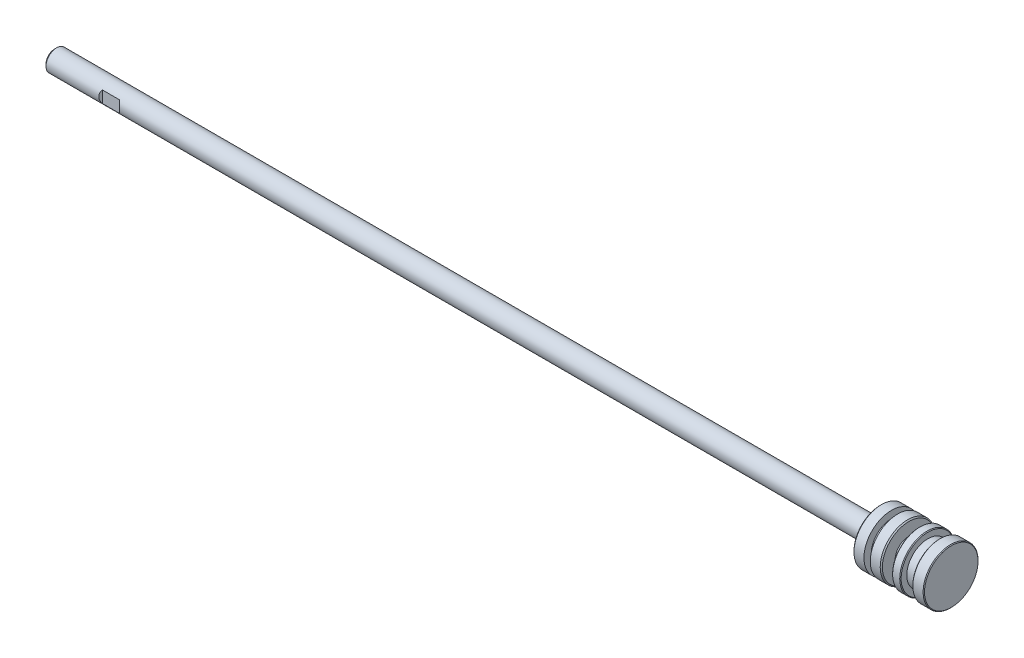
ISO-10303-21;
HEADER;
FILE_DESCRIPTION(('STEP AP214'),'2;1');
FILE_NAME('part.step','',(''),(''),'','','');
FILE_SCHEMA(('AUTOMOTIVE_DESIGN { 1 0 10303 214 1 1 1 1 }'));
ENDSEC;
DATA;
#1=APPLICATION_CONTEXT('core data for automotive mechanical design processes');
#2=APPLICATION_PROTOCOL_DEFINITION('international standard','automotive_design',2000,#1);
#3=PRODUCT_CONTEXT('',#1,'mechanical');
#4=PRODUCT('Part','Part','',(#3));
#5=PRODUCT_RELATED_PRODUCT_CATEGORY('part','',(#4));
#6=PRODUCT_DEFINITION_FORMATION('','',#4);
#7=PRODUCT_DEFINITION_CONTEXT('part definition',#1,'design');
#8=PRODUCT_DEFINITION('design','',#6,#7);
#9=PRODUCT_DEFINITION_SHAPE('','',#8);
#10=(LENGTH_UNIT() NAMED_UNIT(*) SI_UNIT(.MILLI.,.METRE.));
#11=(NAMED_UNIT(*) PLANE_ANGLE_UNIT() SI_UNIT($,.RADIAN.));
#12=(NAMED_UNIT(*) SI_UNIT($,.STERADIAN.) SOLID_ANGLE_UNIT());
#13=UNCERTAINTY_MEASURE_WITH_UNIT(LENGTH_MEASURE(1.E-05),#10,'distance_accuracy_value','');
#14=(GEOMETRIC_REPRESENTATION_CONTEXT(3) GLOBAL_UNCERTAINTY_ASSIGNED_CONTEXT((#13)) GLOBAL_UNIT_ASSIGNED_CONTEXT((#10,
#11,#12)) REPRESENTATION_CONTEXT('',''));
#15=CARTESIAN_POINT('',(0.,0.,0.));
#16=DIRECTION('',(0.,0.,1.));
#17=DIRECTION('',(1.,0.,0.));
#18=AXIS2_PLACEMENT_3D('',#15,#16,#17);
#19=CARTESIAN_POINT('',(253.,7.55,0.));
#20=DIRECTION('',(-1.,0.,0.));
#21=DIRECTION('',(0.,0.,1.));
#22=AXIS2_PLACEMENT_3D('',#19,#20,#21);
#23=PLANE('',#22);
#24=CARTESIAN_POINT('',(253.,0.,0.));
#25=DIRECTION('',(-1.,0.,0.));
#26=DIRECTION('',(0.,0.,1.));
#27=AXIS2_PLACEMENT_3D('',#24,#25,#26);
#28=CIRCLE('',#27,7.55);
#29=CARTESIAN_POINT('',(253.,0.,7.55));
#30=VERTEX_POINT('',#29);
#31=EDGE_CURVE('E20',#30,#30,#28,.T.);
#32=ORIENTED_EDGE('',*,*,#31,.F.);
#33=EDGE_LOOP('',(#32));
#34=FACE_BOUND('',#33,.T.);
#35=ADVANCED_FACE('F17',(#34),#23,.F.);
#36=CARTESIAN_POINT('',(252.8,0.,0.));
#37=DIRECTION('',(-1.,0.,0.));
#38=DIRECTION('',(0.,0.,1.));
#39=AXIS2_PLACEMENT_3D('',#36,#37,#38);
#40=CONICAL_SURFACE('',#39,7.75,0.785398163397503);
#41=ORIENTED_EDGE('',*,*,#31,.T.);
#42=EDGE_LOOP('',(#41));
#43=FACE_BOUND('',#42,.T.);
#44=CARTESIAN_POINT('',(252.8,0.,0.));
#45=DIRECTION('',(-1.,0.,0.));
#46=DIRECTION('',(0.,0.,1.));
#47=AXIS2_PLACEMENT_3D('',#44,#45,#46);
#48=CIRCLE('',#47,7.75);
#49=CARTESIAN_POINT('',(252.8,0.,7.75));
#50=VERTEX_POINT('',#49);
#51=EDGE_CURVE('E115',#50,#50,#48,.T.);
#52=ORIENTED_EDGE('',*,*,#51,.F.);
#53=EDGE_LOOP('',(#52));
#54=FACE_BOUND('',#53,.T.);
#55=ADVANCED_FACE('F471',(#43,#54),#40,.T.);
#56=CARTESIAN_POINT('',(253.,0.,0.));
#57=DIRECTION('',(-1.,0.,0.));
#58=DIRECTION('',(0.,0.,1.));
#59=AXIS2_PLACEMENT_3D('',#56,#57,#58);
#60=CYLINDRICAL_SURFACE('',#59,7.75);
#61=ORIENTED_EDGE('',*,*,#51,.T.);
#62=EDGE_LOOP('',(#61));
#63=FACE_BOUND('',#62,.T.);
#64=CARTESIAN_POINT('',(249.9,0.,0.));
#65=DIRECTION('',(1.,0.,0.));
#66=DIRECTION('',(0.,0.,-1.));
#67=AXIS2_PLACEMENT_3D('',#64,#65,#66);
#68=CIRCLE('',#67,7.75);
#69=CARTESIAN_POINT('',(249.9,0.,-7.75));
#70=VERTEX_POINT('',#69);
#71=EDGE_CURVE('E111',#70,#70,#68,.F.);
#72=ORIENTED_EDGE('',*,*,#71,.F.);
#73=EDGE_LOOP('',(#72));
#74=FACE_BOUND('',#73,.T.);
#75=ADVANCED_FACE('F463',(#63,#74),#60,.T.);
#76=CARTESIAN_POINT('',(249.9,0.,0.));
#77=DIRECTION('',(1.,0.,0.));
#78=DIRECTION('',(0.,1.,0.));
#79=AXIS2_PLACEMENT_3D('',#76,#77,#78);
#80=CONICAL_SURFACE('',#79,7.75,0.785398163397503);
#81=CARTESIAN_POINT('',(249.7,0.,0.));
#82=DIRECTION('',(1.,0.,0.));
#83=DIRECTION('',(0.,1.,0.));
#84=AXIS2_PLACEMENT_3D('',#81,#82,#83);
#85=CIRCLE('',#84,7.55);
#86=CARTESIAN_POINT('',(249.7,7.55,0.));
#87=VERTEX_POINT('',#86);
#88=EDGE_CURVE('E114',#87,#87,#85,.T.);
#89=ORIENTED_EDGE('',*,*,#88,.T.);
#90=EDGE_LOOP('',(#89));
#91=FACE_BOUND('',#90,.T.);
#92=ORIENTED_EDGE('',*,*,#71,.T.);
#93=EDGE_LOOP('',(#92));
#94=FACE_BOUND('',#93,.T.);
#95=ADVANCED_FACE('F156',(#91,#94),#80,.T.);
#96=CARTESIAN_POINT('',(249.7,5.95,0.));
#97=DIRECTION('',(1.,0.,0.));
#98=DIRECTION('',(0.,0.,-1.));
#99=AXIS2_PLACEMENT_3D('',#96,#97,#98);
#100=PLANE('',#99);
#101=ORIENTED_EDGE('',*,*,#88,.F.);
#102=EDGE_LOOP('',(#101));
#103=FACE_BOUND('',#102,.T.);
#104=CARTESIAN_POINT('',(249.7,0.,0.));
#105=DIRECTION('',(-1.,0.,0.));
#106=DIRECTION('',(0.,0.,1.));
#107=AXIS2_PLACEMENT_3D('',#104,#105,#106);
#108=CIRCLE('',#107,5.95);
#109=CARTESIAN_POINT('',(249.7,0.,5.95));
#110=VERTEX_POINT('',#109);
#111=EDGE_CURVE('E151',#110,#110,#108,.T.);
#112=ORIENTED_EDGE('',*,*,#111,.F.);
#113=EDGE_LOOP('',(#112));
#114=FACE_BOUND('',#113,.T.);
#115=ADVANCED_FACE('F159',(#103,#114),#100,.F.);
#116=CARTESIAN_POINT('',(253.,0.,0.));
#117=DIRECTION('',(-1.,0.,0.));
#118=DIRECTION('',(0.,0.,1.));
#119=AXIS2_PLACEMENT_3D('',#116,#117,#118);
#120=CYLINDRICAL_SURFACE('',#119,5.95);
#121=CARTESIAN_POINT('',(246.4,0.,0.));
#122=DIRECTION('',(-1.,0.,0.));
#123=DIRECTION('',(0.,0.,1.));
#124=AXIS2_PLACEMENT_3D('',#121,#122,#123);
#125=CIRCLE('',#124,5.95);
#126=CARTESIAN_POINT('',(246.4,0.,5.95));
#127=VERTEX_POINT('',#126);
#128=EDGE_CURVE('E148',#127,#127,#125,.F.);
#129=ORIENTED_EDGE('',*,*,#128,.T.);
#130=EDGE_LOOP('',(#129));
#131=FACE_BOUND('',#130,.T.);
#132=ORIENTED_EDGE('',*,*,#111,.T.);
#133=EDGE_LOOP('',(#132));
#134=FACE_BOUND('',#133,.T.);
#135=ADVANCED_FACE('F162',(#131,#134),#120,.T.);
#136=CARTESIAN_POINT('',(246.4,7.55,0.));
#137=DIRECTION('',(-1.,0.,0.));
#138=DIRECTION('',(0.,0.,1.));
#139=AXIS2_PLACEMENT_3D('',#136,#137,#138);
#140=PLANE('',#139);
#141=ORIENTED_EDGE('',*,*,#128,.F.);
#142=EDGE_LOOP('',(#141));
#143=FACE_BOUND('',#142,.T.);
#144=CARTESIAN_POINT('',(246.4,0.,0.));
#145=DIRECTION('',(-1.,0.,0.));
#146=DIRECTION('',(0.,-1.,0.));
#147=AXIS2_PLACEMENT_3D('',#144,#145,#146);
#148=CIRCLE('',#147,7.55);
#149=CARTESIAN_POINT('',(246.4,-7.55,0.));
#150=VERTEX_POINT('',#149);
#151=EDGE_CURVE('E110',#150,#150,#148,.T.);
#152=ORIENTED_EDGE('',*,*,#151,.F.);
#153=EDGE_LOOP('',(#152));
#154=FACE_BOUND('',#153,.T.);
#155=ADVANCED_FACE('F167',(#143,#154),#140,.F.);
#156=CARTESIAN_POINT('',(246.2,0.,0.));
#157=DIRECTION('',(-1.,0.,0.));
#158=DIRECTION('',(0.,-1.,0.));
#159=AXIS2_PLACEMENT_3D('',#156,#157,#158);
#160=CONICAL_SURFACE('',#159,7.75,0.785398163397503);
#161=ORIENTED_EDGE('',*,*,#151,.T.);
#162=EDGE_LOOP('',(#161));
#163=FACE_BOUND('',#162,.T.);
#164=CARTESIAN_POINT('',(246.2,0.,0.));
#165=DIRECTION('',(-1.,0.,0.));
#166=DIRECTION('',(0.,0.,1.));
#167=AXIS2_PLACEMENT_3D('',#164,#165,#166);
#168=CIRCLE('',#167,7.75);
#169=CARTESIAN_POINT('',(246.2,0.,7.75));
#170=VERTEX_POINT('',#169);
#171=EDGE_CURVE('E107',#170,#170,#168,.T.);
#172=ORIENTED_EDGE('',*,*,#171,.F.);
#173=EDGE_LOOP('',(#172));
#174=FACE_BOUND('',#173,.T.);
#175=ADVANCED_FACE('F174',(#163,#174),#160,.T.);
#176=CARTESIAN_POINT('',(253.,0.,0.));
#177=DIRECTION('',(-1.,0.,0.));
#178=DIRECTION('',(0.,0.,1.));
#179=AXIS2_PLACEMENT_3D('',#176,#177,#178);
#180=CYLINDRICAL_SURFACE('',#179,7.75);
#181=ORIENTED_EDGE('',*,*,#171,.T.);
#182=EDGE_LOOP('',(#181));
#183=FACE_BOUND('',#182,.T.);
#184=CARTESIAN_POINT('',(244.2,0.,0.));
#185=DIRECTION('',(1.,0.,0.));
#186=DIRECTION('',(0.,0.,-1.));
#187=AXIS2_PLACEMENT_3D('',#184,#185,#186);
#188=CIRCLE('',#187,7.75);
#189=CARTESIAN_POINT('',(244.2,0.,-7.75));
#190=VERTEX_POINT('',#189);
#191=EDGE_CURVE('E103',#190,#190,#188,.F.);
#192=ORIENTED_EDGE('',*,*,#191,.F.);
#193=EDGE_LOOP('',(#192));
#194=FACE_BOUND('',#193,.T.);
#195=ADVANCED_FACE('F256',(#183,#194),#180,.T.);
#196=CARTESIAN_POINT('',(244.2,0.,0.));
#197=DIRECTION('',(1.,0.,0.));
#198=DIRECTION('',(0.,0.,-1.));
#199=AXIS2_PLACEMENT_3D('',#196,#197,#198);
#200=CONICAL_SURFACE('',#199,7.75,0.785398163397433);
#201=CARTESIAN_POINT('',(244.,0.,0.));
#202=DIRECTION('',(1.,0.,0.));
#203=DIRECTION('',(0.,0.,-1.));
#204=AXIS2_PLACEMENT_3D('',#201,#202,#203);
#205=CIRCLE('',#204,7.55);
#206=CARTESIAN_POINT('',(244.,0.,-7.55));
#207=VERTEX_POINT('',#206);
#208=EDGE_CURVE('E106',#207,#207,#205,.T.);
#209=ORIENTED_EDGE('',*,*,#208,.T.);
#210=EDGE_LOOP('',(#209));
#211=FACE_BOUND('',#210,.T.);
#212=ORIENTED_EDGE('',*,*,#191,.T.);
#213=EDGE_LOOP('',(#212));
#214=FACE_BOUND('',#213,.T.);
#215=ADVANCED_FACE('F252',(#211,#214),#200,.T.);
#216=CARTESIAN_POINT('',(244.,3.85,0.));
#217=DIRECTION('',(1.,0.,0.));
#218=DIRECTION('',(0.,0.,-1.));
#219=AXIS2_PLACEMENT_3D('',#216,#217,#218);
#220=PLANE('',#219);
#221=ORIENTED_EDGE('',*,*,#208,.F.);
#222=EDGE_LOOP('',(#221));
#223=FACE_BOUND('',#222,.T.);
#224=CARTESIAN_POINT('',(244.,0.,0.));
#225=DIRECTION('',(-1.,0.,0.));
#226=DIRECTION('',(0.,0.,1.));
#227=AXIS2_PLACEMENT_3D('',#224,#225,#226);
#228=CIRCLE('',#227,3.85);
#229=CARTESIAN_POINT('',(244.,0.,3.85));
#230=VERTEX_POINT('',#229);
#231=EDGE_CURVE('E141',#230,#230,#228,.T.);
#232=ORIENTED_EDGE('',*,*,#231,.F.);
#233=EDGE_LOOP('',(#232));
#234=FACE_BOUND('',#233,.T.);
#235=ADVANCED_FACE('F248',(#223,#234),#220,.F.);
#236=CARTESIAN_POINT('',(253.,0.,0.));
#237=DIRECTION('',(-1.,0.,0.));
#238=DIRECTION('',(0.,0.,1.));
#239=AXIS2_PLACEMENT_3D('',#236,#237,#238);
#240=CYLINDRICAL_SURFACE('',#239,3.85);
#241=CARTESIAN_POINT('',(241.,0.,0.));
#242=DIRECTION('',(-1.,0.,0.));
#243=DIRECTION('',(0.,0.,1.));
#244=AXIS2_PLACEMENT_3D('',#241,#242,#243);
#245=CIRCLE('',#244,3.85);
#246=CARTESIAN_POINT('',(241.,0.,3.85));
#247=VERTEX_POINT('',#246);
#248=EDGE_CURVE('E138',#247,#247,#245,.F.);
#249=ORIENTED_EDGE('',*,*,#248,.T.);
#250=EDGE_LOOP('',(#249));
#251=FACE_BOUND('',#250,.T.);
#252=ORIENTED_EDGE('',*,*,#231,.T.);
#253=EDGE_LOOP('',(#252));
#254=FACE_BOUND('',#253,.T.);
#255=ADVANCED_FACE('F244',(#251,#254),#240,.T.);
#256=CARTESIAN_POINT('',(241.,7.45,0.));
#257=DIRECTION('',(-1.,0.,0.));
#258=DIRECTION('',(0.,0.,1.));
#259=AXIS2_PLACEMENT_3D('',#256,#257,#258);
#260=PLANE('',#259);
#261=ORIENTED_EDGE('',*,*,#248,.F.);
#262=EDGE_LOOP('',(#261));
#263=FACE_BOUND('',#262,.T.);
#264=CARTESIAN_POINT('',(241.,0.,0.));
#265=DIRECTION('',(-1.,0.,0.));
#266=DIRECTION('',(0.,-1.,0.));
#267=AXIS2_PLACEMENT_3D('',#264,#265,#266);
#268=CIRCLE('',#267,7.45);
#269=CARTESIAN_POINT('',(241.,-7.45,0.));
#270=VERTEX_POINT('',#269);
#271=EDGE_CURVE('E102',#270,#270,#268,.T.);
#272=ORIENTED_EDGE('',*,*,#271,.F.);
#273=EDGE_LOOP('',(#272));
#274=FACE_BOUND('',#273,.T.);
#275=ADVANCED_FACE('F240',(#263,#274),#260,.F.);
#276=CARTESIAN_POINT('',(240.7,0.,0.));
#277=DIRECTION('',(-1.,0.,0.));
#278=DIRECTION('',(0.,-1.,0.));
#279=AXIS2_PLACEMENT_3D('',#276,#277,#278);
#280=CONICAL_SURFACE('',#279,7.75,0.785398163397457);
#281=CARTESIAN_POINT('',(240.7,0.,0.));
#282=DIRECTION('',(-1.,0.,0.));
#283=DIRECTION('',(0.,0.,1.));
#284=AXIS2_PLACEMENT_3D('',#281,#282,#283);
#285=CIRCLE('',#284,7.75);
#286=CARTESIAN_POINT('',(240.7,0.,7.75));
#287=VERTEX_POINT('',#286);
#288=EDGE_CURVE('E98',#287,#287,#285,.T.);
#289=ORIENTED_EDGE('',*,*,#288,.F.);
#290=EDGE_LOOP('',(#289));
#291=FACE_BOUND('',#290,.T.);
#292=ORIENTED_EDGE('',*,*,#271,.T.);
#293=EDGE_LOOP('',(#292));
#294=FACE_BOUND('',#293,.T.);
#295=ADVANCED_FACE('F236',(#291,#294),#280,.T.);
#296=CARTESIAN_POINT('',(253.,0.,0.));
#297=DIRECTION('',(-1.,0.,0.));
#298=DIRECTION('',(0.,0.,1.));
#299=AXIS2_PLACEMENT_3D('',#296,#297,#298);
#300=CYLINDRICAL_SURFACE('',#299,7.75);
#301=CARTESIAN_POINT('',(237.89,0.,0.));
#302=DIRECTION('',(-1.,0.,0.));
#303=DIRECTION('',(0.,0.,1.));
#304=AXIS2_PLACEMENT_3D('',#301,#302,#303);
#305=CIRCLE('',#304,7.75);
#306=CARTESIAN_POINT('',(237.89,0.,7.75));
#307=VERTEX_POINT('',#306);
#308=EDGE_CURVE('E101',#307,#307,#305,.F.);
#309=ORIENTED_EDGE('',*,*,#308,.T.);
#310=EDGE_LOOP('',(#309));
#311=FACE_BOUND('',#310,.T.);
#312=ORIENTED_EDGE('',*,*,#288,.T.);
#313=EDGE_LOOP('',(#312));
#314=FACE_BOUND('',#313,.T.);
#315=ADVANCED_FACE('F232',(#311,#314),#300,.T.);
#316=CARTESIAN_POINT('',(237.89,5.7,0.));
#317=DIRECTION('',(1.,0.,0.));
#318=DIRECTION('',(0.,0.,-1.));
#319=AXIS2_PLACEMENT_3D('',#316,#317,#318);
#320=PLANE('',#319);
#321=ORIENTED_EDGE('',*,*,#308,.F.);
#322=EDGE_LOOP('',(#321));
#323=FACE_BOUND('',#322,.T.);
#324=CARTESIAN_POINT('',(237.89,0.,0.));
#325=DIRECTION('',(-1.,0.,0.));
#326=DIRECTION('',(0.,0.,1.));
#327=AXIS2_PLACEMENT_3D('',#324,#325,#326);
#328=CIRCLE('',#327,5.7);
#329=CARTESIAN_POINT('',(237.89,0.,5.7));
#330=VERTEX_POINT('',#329);
#331=EDGE_CURVE('E131',#330,#330,#328,.T.);
#332=ORIENTED_EDGE('',*,*,#331,.F.);
#333=EDGE_LOOP('',(#332));
#334=FACE_BOUND('',#333,.T.);
#335=ADVANCED_FACE('F228',(#323,#334),#320,.F.);
#336=CARTESIAN_POINT('',(253.,0.,0.));
#337=DIRECTION('',(-1.,0.,0.));
#338=DIRECTION('',(0.,0.,1.));
#339=AXIS2_PLACEMENT_3D('',#336,#337,#338);
#340=CYLINDRICAL_SURFACE('',#339,5.7);
#341=CARTESIAN_POINT('',(236.11,0.,0.));
#342=DIRECTION('',(-1.,0.,0.));
#343=DIRECTION('',(0.,0.,1.));
#344=AXIS2_PLACEMENT_3D('',#341,#342,#343);
#345=CIRCLE('',#344,5.7);
#346=CARTESIAN_POINT('',(236.11,0.,5.7));
#347=VERTEX_POINT('',#346);
#348=EDGE_CURVE('E128',#347,#347,#345,.F.);
#349=ORIENTED_EDGE('',*,*,#348,.T.);
#350=EDGE_LOOP('',(#349));
#351=FACE_BOUND('',#350,.T.);
#352=ORIENTED_EDGE('',*,*,#331,.T.);
#353=EDGE_LOOP('',(#352));
#354=FACE_BOUND('',#353,.T.);
#355=ADVANCED_FACE('F224',(#351,#354),#340,.T.);
#356=CARTESIAN_POINT('',(236.11,7.75,0.));
#357=DIRECTION('',(-1.,0.,0.));
#358=DIRECTION('',(0.,0.,1.));
#359=AXIS2_PLACEMENT_3D('',#356,#357,#358);
#360=PLANE('',#359);
#361=ORIENTED_EDGE('',*,*,#348,.F.);
#362=EDGE_LOOP('',(#361));
#363=FACE_BOUND('',#362,.T.);
#364=CARTESIAN_POINT('',(236.11,0.,0.));
#365=DIRECTION('',(-1.,0.,0.));
#366=DIRECTION('',(0.,0.,1.));
#367=AXIS2_PLACEMENT_3D('',#364,#365,#366);
#368=CIRCLE('',#367,7.75);
#369=CARTESIAN_POINT('',(236.11,0.,7.75));
#370=VERTEX_POINT('',#369);
#371=EDGE_CURVE('E97',#370,#370,#368,.T.);
#372=ORIENTED_EDGE('',*,*,#371,.F.);
#373=EDGE_LOOP('',(#372));
#374=FACE_BOUND('',#373,.T.);
#375=ADVANCED_FACE('F220',(#363,#374),#360,.F.);
#376=CARTESIAN_POINT('',(253.,0.,0.));
#377=DIRECTION('',(-1.,0.,0.));
#378=DIRECTION('',(0.,0.,1.));
#379=AXIS2_PLACEMENT_3D('',#376,#377,#378);
#380=CYLINDRICAL_SURFACE('',#379,7.75);
#381=ORIENTED_EDGE('',*,*,#371,.T.);
#382=EDGE_LOOP('',(#381));
#383=FACE_BOUND('',#382,.T.);
#384=CARTESIAN_POINT('',(233.3,0.,0.));
#385=DIRECTION('',(1.,0.,0.));
#386=DIRECTION('',(0.,0.,-1.));
#387=AXIS2_PLACEMENT_3D('',#384,#385,#386);
#388=CIRCLE('',#387,7.75);
#389=CARTESIAN_POINT('',(233.3,0.,-7.75));
#390=VERTEX_POINT('',#389);
#391=EDGE_CURVE('E94',#390,#390,#388,.F.);
#392=ORIENTED_EDGE('',*,*,#391,.F.);
#393=EDGE_LOOP('',(#392));
#394=FACE_BOUND('',#393,.T.);
#395=ADVANCED_FACE('F216',(#383,#394),#380,.T.);
#396=CARTESIAN_POINT('',(233.3,0.,0.));
#397=DIRECTION('',(1.,0.,0.));
#398=DIRECTION('',(0.,0.,-1.));
#399=AXIS2_PLACEMENT_3D('',#396,#397,#398);
#400=CONICAL_SURFACE('',#399,7.75,0.785398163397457);
#401=CARTESIAN_POINT('',(233.,0.,0.));
#402=DIRECTION('',(1.,0.,0.));
#403=DIRECTION('',(0.,0.,-1.));
#404=AXIS2_PLACEMENT_3D('',#401,#402,#403);
#405=CIRCLE('',#404,7.45);
#406=CARTESIAN_POINT('',(233.,0.,-7.45));
#407=VERTEX_POINT('',#406);
#408=EDGE_CURVE('E92',#407,#407,#405,.T.);
#409=ORIENTED_EDGE('',*,*,#408,.T.);
#410=EDGE_LOOP('',(#409));
#411=FACE_BOUND('',#410,.T.);
#412=ORIENTED_EDGE('',*,*,#391,.T.);
#413=EDGE_LOOP('',(#412));
#414=FACE_BOUND('',#413,.T.);
#415=ADVANCED_FACE('F212',(#411,#414),#400,.T.);
#416=CARTESIAN_POINT('',(0.,0.,0.));
#417=DIRECTION('',(1.,0.,0.));
#418=DIRECTION('',(0.,0.,-1.));
#419=AXIS2_PLACEMENT_3D('',#416,#417,#418);
#420=PLANE('',#419);
#421=CARTESIAN_POINT('',(0.,0.,0.));
#422=DIRECTION('',(1.,0.,0.));
#423=DIRECTION('',(0.,0.,-1.));
#424=AXIS2_PLACEMENT_3D('',#421,#422,#423);
#425=CIRCLE('',#424,2.38649999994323);
#426=CARTESIAN_POINT('',(0.,0.,-2.38649999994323));
#427=VERTEX_POINT('',#426);
#428=EDGE_CURVE('E75',#427,#427,#425,.T.);
#429=ORIENTED_EDGE('',*,*,#428,.F.);
#430=EDGE_LOOP('',(#429));
#431=FACE_BOUND('',#430,.T.);
#432=ADVANCED_FACE('F208',(#431),#420,.F.);
#433=CARTESIAN_POINT('',(233.,3.,0.));
#434=DIRECTION('',(1.,0.,0.));
#435=DIRECTION('',(0.,0.,-1.));
#436=AXIS2_PLACEMENT_3D('',#433,#434,#435);
#437=PLANE('',#436);
#438=ORIENTED_EDGE('',*,*,#408,.F.);
#439=EDGE_LOOP('',(#438));
#440=FACE_BOUND('',#439,.T.);
#441=CARTESIAN_POINT('',(233.,0.,0.));
#442=DIRECTION('',(-1.,0.,0.));
#443=DIRECTION('',(0.,0.,1.));
#444=AXIS2_PLACEMENT_3D('',#441,#442,#443);
#445=CIRCLE('',#444,3.);
#446=CARTESIAN_POINT('',(233.,0.,3.));
#447=VERTEX_POINT('',#446);
#448=EDGE_CURVE('E121',#447,#447,#445,.T.);
#449=ORIENTED_EDGE('',*,*,#448,.F.);
#450=EDGE_LOOP('',(#449));
#451=FACE_BOUND('',#450,.T.);
#452=ADVANCED_FACE('F205',(#440,#451),#437,.F.);
#453=CARTESIAN_POINT('',(30.3,-2.5,12.));
#454=DIRECTION('',(0.707106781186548,0.,-0.707106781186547));
#455=DIRECTION('',(-0.707106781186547,0.,-0.707106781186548));
#456=AXIS2_PLACEMENT_3D('',#453,#454,#455);
#457=PLANE('',#456);
#458=CARTESIAN_POINT('',(18.3,0.,0.));
#459=DIRECTION('',(0.707106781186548,0.,-0.707106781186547));
#460=DIRECTION('',(-0.707106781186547,0.,-0.707106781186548));
#461=AXIS2_PLACEMENT_3D('',#458,#459,#460);
#462=ELLIPSE('',#461,4.24264068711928,3.);
#463=CARTESIAN_POINT('',(20.8,1.65831239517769,2.5));
#464=VERTEX_POINT('',#463);
#465=CARTESIAN_POINT('',(20.8,-1.65831239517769,2.50000000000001));
#466=VERTEX_POINT('',#465);
#467=EDGE_CURVE('E54',#464,#466,#462,.T.);
#468=ORIENTED_EDGE('',*,*,#467,.F.);
#469=DIRECTION('',(0.,1.,0.));
#470=VECTOR('',#469,1.);
#471=CARTESIAN_POINT('',(20.8,-2.5,2.5));
#472=LINE('',#471,#470);
#473=EDGE_CURVE('E76',#464,#466,#472,.F.);
#474=ORIENTED_EDGE('',*,*,#473,.T.);
#475=EDGE_LOOP('',(#468,#474));
#476=FACE_BOUND('',#475,.T.);
#477=ADVANCED_FACE('F202',(#476),#457,.F.);
#478=CARTESIAN_POINT('',(20.8,-2.5,2.5));
#479=DIRECTION('',(0.,0.,-1.));
#480=DIRECTION('',(-1.,0.,0.));
#481=AXIS2_PLACEMENT_3D('',#478,#479,#480);
#482=PLANE('',#481);
#483=DIRECTION('',(-1.,0.,0.));
#484=VECTOR('',#483,1.);
#485=CARTESIAN_POINT('',(253.,1.6583123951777,2.5));
#486=LINE('',#485,#484);
#487=CARTESIAN_POINT('',(16.,1.6583123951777,2.5));
#488=VERTEX_POINT('',#487);
#489=EDGE_CURVE('E66',#488,#464,#486,.F.);
#490=ORIENTED_EDGE('',*,*,#489,.F.);
#491=DIRECTION('',(0.,1.,0.));
#492=VECTOR('',#491,1.);
#493=CARTESIAN_POINT('',(16.,-2.5,2.5));
#494=LINE('',#493,#492);
#495=CARTESIAN_POINT('',(16.,-1.6583123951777,2.5));
#496=VERTEX_POINT('',#495);
#497=EDGE_CURVE('E72',#488,#496,#494,.F.);
#498=ORIENTED_EDGE('',*,*,#497,.T.);
#499=DIRECTION('',(-1.,0.,0.));
#500=VECTOR('',#499,1.);
#501=CARTESIAN_POINT('',(253.,-1.65831239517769,2.50000000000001));
#502=LINE('',#501,#500);
#503=EDGE_CURVE('E68',#466,#496,#502,.T.);
#504=ORIENTED_EDGE('',*,*,#503,.F.);
#505=ORIENTED_EDGE('',*,*,#473,.F.);
#506=EDGE_LOOP('',(#490,#498,#504,#505));
#507=FACE_BOUND('',#506,.T.);
#508=ADVANCED_FACE('F78',(#507),#482,.F.);
#509=CARTESIAN_POINT('',(16.,-2.5,2.5));
#510=DIRECTION('',(-0.707106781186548,0.,-0.707106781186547));
#511=DIRECTION('',(-0.707106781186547,0.,0.707106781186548));
#512=AXIS2_PLACEMENT_3D('',#509,#510,#511);
#513=PLANE('',#512);
#514=ORIENTED_EDGE('',*,*,#497,.F.);
#515=CARTESIAN_POINT('',(18.5,0.,0.));
#516=DIRECTION('',(-0.707106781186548,0.,-0.707106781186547));
#517=DIRECTION('',(-0.707106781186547,0.,0.707106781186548));
#518=AXIS2_PLACEMENT_3D('',#515,#516,#517);
#519=ELLIPSE('',#518,4.24264068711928,3.);
#520=EDGE_CURVE('E61',#496,#488,#519,.T.);
#521=ORIENTED_EDGE('',*,*,#520,.F.);
#522=EDGE_LOOP('',(#514,#521));
#523=FACE_BOUND('',#522,.T.);
#524=ADVANCED_FACE('F73',(#523),#513,.F.);
#525=CARTESIAN_POINT('',(0.613500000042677,0.,0.));
#526=DIRECTION('',(1.,0.,0.));
#527=DIRECTION('',(0.,0.,-1.));
#528=AXIS2_PLACEMENT_3D('',#525,#526,#527);
#529=CONICAL_SURFACE('',#528,3.00000000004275,0.785398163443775);
#530=ORIENTED_EDGE('',*,*,#428,.T.);
#531=EDGE_LOOP('',(#530));
#532=FACE_BOUND('',#531,.T.);
#533=CARTESIAN_POINT('',(0.613499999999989,0.,0.));
#534=DIRECTION('',(-1.,0.,0.));
#535=DIRECTION('',(0.,0.,1.));
#536=AXIS2_PLACEMENT_3D('',#533,#534,#535);
#537=CIRCLE('',#536,3.);
#538=CARTESIAN_POINT('',(0.613499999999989,0.,3.));
#539=VERTEX_POINT('',#538);
#540=EDGE_CURVE('E70',#539,#539,#537,.F.);
#541=ORIENTED_EDGE('',*,*,#540,.F.);
#542=EDGE_LOOP('',(#541));
#543=FACE_BOUND('',#542,.T.);
#544=ADVANCED_FACE('F193',(#532,#543),#529,.T.);
#545=CARTESIAN_POINT('',(14.4,-2.5,-4.1));
#546=DIRECTION('',(-0.707106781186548,0.,0.707106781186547));
#547=DIRECTION('',(0.707106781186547,0.,0.707106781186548));
#548=AXIS2_PLACEMENT_3D('',#545,#546,#547);
#549=PLANE('',#548);
#550=CARTESIAN_POINT('',(18.5,0.,0.));
#551=DIRECTION('',(-0.707106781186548,0.,0.707106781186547));
#552=DIRECTION('',(-0.707106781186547,0.,-0.707106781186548));
#553=AXIS2_PLACEMENT_3D('',#550,#551,#552);
#554=ELLIPSE('',#553,4.24264068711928,3.);
#555=CARTESIAN_POINT('',(16.,1.65831239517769,-2.5));
#556=VERTEX_POINT('',#555);
#557=CARTESIAN_POINT('',(16.,-1.65831239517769,-2.5));
#558=VERTEX_POINT('',#557);
#559=EDGE_CURVE('E90',#556,#558,#554,.T.);
#560=ORIENTED_EDGE('',*,*,#559,.F.);
#561=DIRECTION('',(0.,1.,0.));
#562=VECTOR('',#561,1.);
#563=CARTESIAN_POINT('',(16.,-2.5,-2.5));
#564=LINE('',#563,#562);
#565=EDGE_CURVE('E82',#556,#558,#564,.F.);
#566=ORIENTED_EDGE('',*,*,#565,.T.);
#567=EDGE_LOOP('',(#560,#566));
#568=FACE_BOUND('',#567,.T.);
#569=ADVANCED_FACE('F190',(#568),#549,.F.);
#570=CARTESIAN_POINT('',(16.,-2.5,-2.5));
#571=DIRECTION('',(0.,0.,1.));
#572=DIRECTION('',(1.,0.,0.));
#573=AXIS2_PLACEMENT_3D('',#570,#571,#572);
#574=PLANE('',#573);
#575=DIRECTION('',(-1.,0.,0.));
#576=VECTOR('',#575,1.);
#577=CARTESIAN_POINT('',(253.,-1.65831239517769,-2.50000000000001));
#578=LINE('',#577,#576);
#579=CARTESIAN_POINT('',(20.8,-1.65831239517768,-2.5));
#580=VERTEX_POINT('',#579);
#581=EDGE_CURVE('E26',#558,#580,#578,.F.);
#582=ORIENTED_EDGE('',*,*,#581,.F.);
#583=ORIENTED_EDGE('',*,*,#565,.F.);
#584=DIRECTION('',(1.,0.,0.));
#585=VECTOR('',#584,1.);
#586=CARTESIAN_POINT('',(16.,1.6583123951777,-2.5));
#587=LINE('',#586,#585);
#588=CARTESIAN_POINT('',(20.8,1.65831239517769,-2.5));
#589=VERTEX_POINT('',#588);
#590=EDGE_CURVE('E79',#589,#556,#587,.F.);
#591=ORIENTED_EDGE('',*,*,#590,.F.);
#592=DIRECTION('',(0.,1.,0.));
#593=VECTOR('',#592,1.);
#594=CARTESIAN_POINT('',(20.8,-2.5,-2.5));
#595=LINE('',#594,#593);
#596=EDGE_CURVE('E35',#589,#580,#595,.F.);
#597=ORIENTED_EDGE('',*,*,#596,.T.);
#598=EDGE_LOOP('',(#582,#583,#591,#597));
#599=FACE_BOUND('',#598,.T.);
#600=ADVANCED_FACE('F184',(#599),#574,.F.);
#601=CARTESIAN_POINT('',(20.8,-2.5,-2.5));
#602=DIRECTION('',(0.707106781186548,0.,0.707106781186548));
#603=DIRECTION('',(0.707106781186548,0.,-0.707106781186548));
#604=AXIS2_PLACEMENT_3D('',#601,#602,#603);
#605=PLANE('',#604);
#606=ORIENTED_EDGE('',*,*,#596,.F.);
#607=CARTESIAN_POINT('',(18.3,0.,0.));
#608=DIRECTION('',(0.707106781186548,0.,0.707106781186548));
#609=DIRECTION('',(-0.707106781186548,0.,0.707106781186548));
#610=AXIS2_PLACEMENT_3D('',#607,#608,#609);
#611=ELLIPSE('',#610,4.24264068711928,3.);
#612=EDGE_CURVE('E11',#580,#589,#611,.T.);
#613=ORIENTED_EDGE('',*,*,#612,.F.);
#614=EDGE_LOOP('',(#606,#613));
#615=FACE_BOUND('',#614,.T.);
#616=ADVANCED_FACE('F178',(#615),#605,.F.);
#617=CARTESIAN_POINT('',(253.,0.,0.));
#618=DIRECTION('',(-1.,0.,0.));
#619=DIRECTION('',(0.,0.,1.));
#620=AXIS2_PLACEMENT_3D('',#617,#618,#619);
#621=CYLINDRICAL_SURFACE('',#620,3.);
#622=ORIENTED_EDGE('',*,*,#448,.T.);
#623=EDGE_LOOP('',(#622));
#624=FACE_BOUND('',#623,.T.);
#625=ORIENTED_EDGE('',*,*,#489,.T.);
#626=ORIENTED_EDGE('',*,*,#467,.T.);
#627=ORIENTED_EDGE('',*,*,#503,.T.);
#628=ORIENTED_EDGE('',*,*,#520,.T.);
#629=EDGE_LOOP('',(#625,#626,#627,#628));
#630=FACE_BOUND('',#629,.T.);
#631=ORIENTED_EDGE('',*,*,#540,.T.);
#632=EDGE_LOOP('',(#631));
#633=FACE_BOUND('',#632,.T.);
#634=ORIENTED_EDGE('',*,*,#581,.T.);
#635=ORIENTED_EDGE('',*,*,#612,.T.);
#636=ORIENTED_EDGE('',*,*,#590,.T.);
#637=ORIENTED_EDGE('',*,*,#559,.T.);
#638=EDGE_LOOP('',(#634,#635,#636,#637));
#639=FACE_BOUND('',#638,.T.);
#640=ADVANCED_FACE('F63',(#624,#630,#633,#639),#621,.T.);
#641=CLOSED_SHELL('',(#35,#55,#75,#95,#115,#135,#155,#175,#195,#215,#235,#255,#275,#295,#315,
#335,#355,#375,#395,#415,#432,#452,#477,#508,#524,#544,#569,#600,#616,#640));
#642=MANIFOLD_SOLID_BREP('B1',#641);
#643=ADVANCED_BREP_SHAPE_REPRESENTATION('',(#18,#642),#14);
#644=SHAPE_DEFINITION_REPRESENTATION(#9,#643);
ENDSEC;
END-ISO-10303-21;
